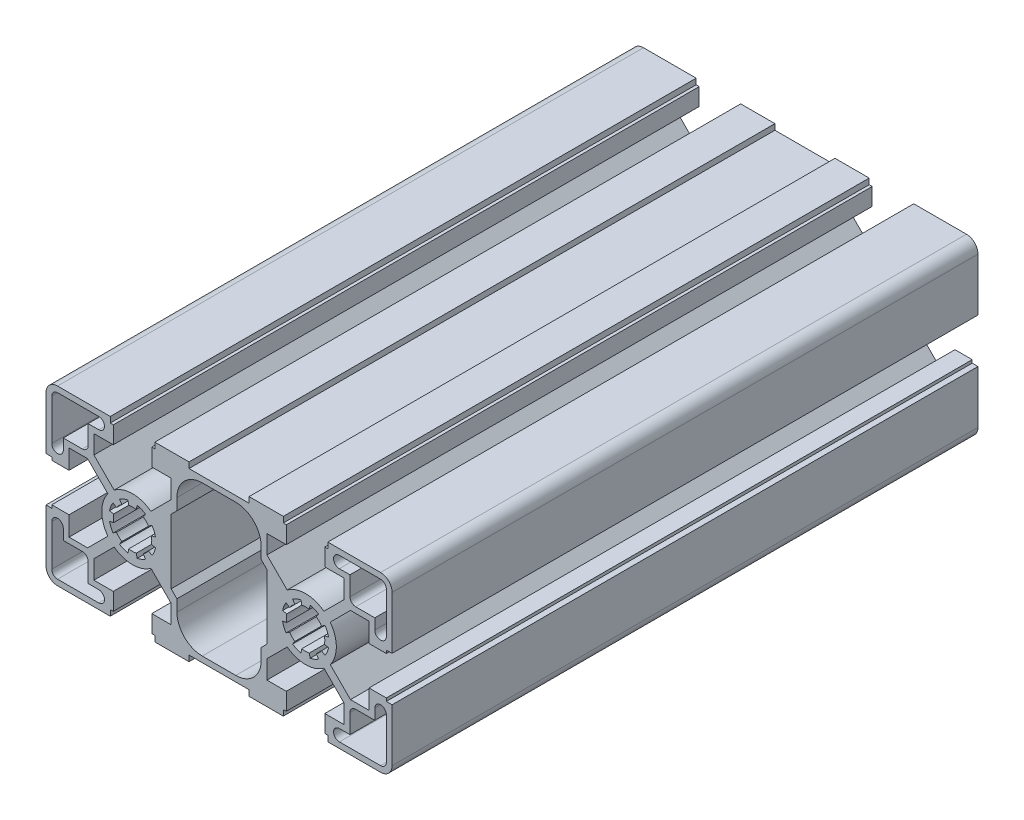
from build123d import *

# Parameters (mm, degrees)
BOSS_EXTRUDE1_DEPTH = 76.2


with BuildPart() as part:
    # Sketch1 → Boss-Extrude1 (new, symmetric)
    with BuildSketch(Plane.XY):
        with BuildLine():
            Line((-42.0116, 22.5044), (-28.2956, 22.5044))
            Line((-28.2956, 22.5044), (-28.2956, 21.0058))
            Line((-28.2956, 21.0058), (-27.5082, 21.0058))
            Line((-27.5082, 21.0058), (-27.5082, 16.51))
            Line((-27.5082, 16.51), (-32.5501, 16.51))
            Line((-32.5501, 16.51), (-32.5501, 11.680106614))
            Line((-32.5501, 11.680106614), (-27.285426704, 6.415433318))
            ThreePointArc((-27.285426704, 6.415433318), (-22.5044, 8.001), (-17.723373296, 6.415433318))
            Line((-17.723373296, 6.415433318), (-12.4587, 11.680106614))
            Line((-12.4587, 11.680106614), (-12.4587, 16.51))
            Line((-12.4587, 16.51), (-17.5006, 16.51))
            Line((-17.5006, 16.51), (-17.5006, 21.0058))
            Line((-17.5006, 21.0058), (-16.7132, 21.0058))
            Line((-16.7132, 21.0058), (-16.7132, 22.5044))
            Line((-16.7132, 22.5044), (-7.8105, 22.5044))
            Line((-7.8105, 22.5044), (-7.8105, 21.0058))
            Line((-7.8105, 21.0058), (7.8105, 21.0058))
            Line((7.8105, 21.0058), (7.8105, 22.5044))
            Line((7.8105, 22.5044), (16.7132, 22.5044))
            Line((16.7132, 22.5044), (16.7132, 21.0058))
            Line((16.7132, 21.0058), (17.5006, 21.0058))
            Line((17.5006, 21.0058), (17.5006, 16.51))
            Line((17.5006, 16.51), (12.4587, 16.51))
            Line((12.4587, 16.51), (12.4587, 11.680106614))
            Line((12.4587, 11.680106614), (17.723373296, 6.415433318))
            ThreePointArc((17.723373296, 6.415433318), (22.5044, 8.001), (27.285426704, 6.415433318))
            Line((27.285426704, 6.415433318), (32.5501, 11.680106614))
            Line((32.5501, 11.680106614), (32.5501, 16.51))
            Line((32.5501, 16.51), (27.5082, 16.51))
            Line((27.5082, 16.51), (27.5082, 21.0058))
            Line((27.5082, 21.0058), (28.2956, 21.0058))
            Line((28.2956, 21.0058), (28.2956, 22.5044))
            Line((28.2956, 22.5044), (42.0116, 22.5044))
            ThreePointArc((42.0116, 22.5044), (44.130940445, 21.626540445), (45.0088, 19.5072))
            Line((45.0088, 19.5072), (45.0088, 5.7912))
            Line((45.0088, 5.7912), (43.5102, 5.7912))
            Line((43.5102, 5.7912), (43.5102, 5.0038))
            Line((43.5102, 5.0038), (39.0144, 5.0038))
            Line((39.0144, 5.0038), (39.0144, 10.0457))
            Line((39.0144, 10.0457), (34.184506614, 10.0457))
            Line((34.184506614, 10.0457), (28.919833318, 4.781026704))
            ThreePointArc((28.919833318, 4.781026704), (30.5054, 0), (28.919833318, -4.781026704))
            Line((28.919833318, -4.781026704), (34.184506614, -10.0457))
            Line((34.184506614, -10.0457), (39.0144, -10.0457))
            Line((39.0144, -10.0457), (39.0144, -5.0038))
            Line((39.0144, -5.0038), (43.5102, -5.0038))
            Line((43.5102, -5.0038), (43.5102, -5.7912))
            Line((43.5102, -5.7912), (45.0088, -5.7912))
            Line((45.0088, -5.7912), (45.0088, -19.5072))
            ThreePointArc((45.0088, -19.5072), (44.130940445, -21.626540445), (42.0116, -22.5044))
            Line((42.0116, -22.5044), (28.2956, -22.5044))
            Line((28.2956, -22.5044), (28.2956, -21.0058))
            Line((28.2956, -21.0058), (27.5082, -21.0058))
            Line((27.5082, -21.0058), (27.5082, -16.51))
            Line((27.5082, -16.51), (32.5501, -16.51))
            Line((32.5501, -16.51), (32.5501, -11.680106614))
            Line((32.5501, -11.680106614), (27.285426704, -6.415433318))
            ThreePointArc((27.285426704, -6.415433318), (22.5044, -8.001), (17.723373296, -6.415433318))
            Line((17.723373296, -6.415433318), (12.4587, -11.680106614))
            Line((12.4587, -11.680106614), (12.4587, -16.51))
            Line((12.4587, -16.51), (17.5006, -16.51))
            Line((17.5006, -16.51), (17.5006, -21.0058))
            Line((17.5006, -21.0058), (16.7132, -21.0058))
            Line((16.7132, -21.0058), (16.7132, -22.5044))
            Line((16.7132, -22.5044), (7.8105, -22.5044))
            Line((7.8105, -22.5044), (7.8105, -21.0058))
            Line((7.8105, -21.0058), (-7.8105, -21.0058))
            Line((-7.8105, -21.0058), (-7.8105, -22.5044))
            Line((-7.8105, -22.5044), (-16.7132, -22.5044))
            Line((-16.7132, -22.5044), (-16.7132, -21.0058))
            Line((-16.7132, -21.0058), (-17.5006, -21.0058))
            Line((-17.5006, -21.0058), (-17.5006, -16.51))
            Line((-17.5006, -16.51), (-12.4587, -16.51))
            Line((-12.4587, -16.51), (-12.4587, -11.680106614))
            Line((-12.4587, -11.680106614), (-17.723373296, -6.415433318))
            ThreePointArc((-17.723373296, -6.415433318), (-22.5044, -8.001), (-27.285426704, -6.415433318))
            Line((-27.285426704, -6.415433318), (-32.5501, -11.680106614))
            Line((-32.5501, -11.680106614), (-32.5501, -16.51))
            Line((-32.5501, -16.51), (-27.5082, -16.51))
            Line((-27.5082, -16.51), (-27.5082, -21.0058))
            Line((-27.5082, -21.0058), (-28.2956, -21.0058))
            Line((-28.2956, -21.0058), (-28.2956, -22.5044))
            Line((-28.2956, -22.5044), (-42.0116, -22.5044))
            ThreePointArc((-42.0116, -22.5044), (-44.130940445, -21.626540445), (-45.0088, -19.5072))
            Line((-45.0088, -19.5072), (-45.0088, -5.7912))
            Line((-45.0088, -5.7912), (-43.5102, -5.7912))
            Line((-43.5102, -5.7912), (-43.5102, -5.0038))
            Line((-43.5102, -5.0038), (-39.0144, -5.0038))
            Line((-39.0144, -5.0038), (-39.0144, -10.0457))
            Line((-39.0144, -10.0457), (-34.184506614, -10.0457))
            Line((-34.184506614, -10.0457), (-28.919833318, -4.781026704))
            ThreePointArc((-28.919833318, -4.781026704), (-30.5054, 0), (-28.919833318, 4.781026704))
            Line((-28.919833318, 4.781026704), (-34.184506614, 10.0457))
            Line((-34.184506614, 10.0457), (-39.0144, 10.0457))
            Line((-39.0144, 10.0457), (-39.0144, 5.0038))
            Line((-39.0144, 5.0038), (-43.5102, 5.0038))
            Line((-43.5102, 5.0038), (-43.5102, 5.7912))
            Line((-43.5102, 5.7912), (-45.0088, 5.7912))
            Line((-45.0088, 5.7912), (-45.0088, 19.5072))
            ThreePointArc((-45.0088, 19.5072), (-44.130940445, 21.626540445), (-42.0116, 22.5044))
        make_face()
        with BuildLine():
            Line((-40.513, 11.5443), (-35.5473, 11.5443))
            ThreePointArc((-35.5473, 11.5443), (-34.487629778, 11.983229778), (-34.0487, 13.0429))
            Line((-34.0487, 13.0429), (-34.0487, 18.0086))
            Line((-34.0487, 18.0086), (-31.2928, 18.0086))
            ThreePointArc((-31.2928, 18.0086), (-29.7942, 19.5072), (-31.2928, 21.0058))
            Line((-31.2928, 21.0058), (-42.0116, 21.0058))
            ThreePointArc((-42.0116, 21.0058), (-43.071270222, 20.566870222), (-43.5102, 19.5072))
            Line((-43.5102, 19.5072), (-43.5102, 8.7884))
            ThreePointArc((-43.5102, 8.7884), (-42.0116, 7.2898), (-40.513, 8.7884))
            Line((-40.513, 8.7884), (-40.513, 11.5443))
        make_face(mode=Mode.SUBTRACT)
        with BuildLine():
            Line((-21.315129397, 5.978867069), (-21.528207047, 4.907653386))
            ThreePointArc((-21.528207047, 4.907653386), (-22.5044, 5.0038), (-23.480592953, 4.907653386))
            Line((-23.480592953, 4.907653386), (-23.693670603, 5.978867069))
            ThreePointArc((-23.693670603, 5.978867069), (-24.837238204, 5.63196963), (-25.89115614, 5.068638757))
            Line((-25.89115614, 5.068638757), (-25.284362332, 4.160507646))
            ThreePointArc((-25.284362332, 4.160507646), (-26.042620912, 3.538220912), (-26.664907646, 2.779962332))
            Line((-26.664907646, 2.779962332), (-27.573038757, 3.38675614))
            ThreePointArc((-27.573038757, 3.38675614), (-28.13636963, 2.332838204), (-28.483267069, 1.189270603))
            Line((-28.483267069, 1.189270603), (-27.412053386, 0.976192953))
            ThreePointArc((-27.412053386, 0.976192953), (-27.5082, 0), (-27.412053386, -0.976192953))
            Line((-27.412053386, -0.976192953), (-28.483267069, -1.189270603))
            ThreePointArc((-28.483267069, -1.189270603), (-28.13636963, -2.332838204), (-27.573038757, -3.38675614))
            Line((-27.573038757, -3.38675614), (-26.664907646, -2.779962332))
            ThreePointArc((-26.664907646, -2.779962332), (-26.042620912, -3.538220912), (-25.284362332, -4.160507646))
            Line((-25.284362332, -4.160507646), (-25.89115614, -5.068638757))
            ThreePointArc((-25.89115614, -5.068638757), (-24.837238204, -5.63196963), (-23.693670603, -5.978867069))
            Line((-23.693670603, -5.978867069), (-23.480592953, -4.907653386))
            ThreePointArc((-23.480592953, -4.907653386), (-22.5044, -5.0038), (-21.528207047, -4.907653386))
            Line((-21.528207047, -4.907653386), (-21.315129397, -5.978867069))
            ThreePointArc((-21.315129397, -5.978867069), (-20.171561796, -5.63196963), (-19.11764386, -5.068638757))
            Line((-19.11764386, -5.068638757), (-19.724437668, -4.160507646))
            ThreePointArc((-19.724437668, -4.160507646), (-18.966179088, -3.538220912), (-18.343892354, -2.779962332))
            Line((-18.343892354, -2.779962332), (-17.435761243, -3.38675614))
            ThreePointArc((-17.435761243, -3.38675614), (-16.87243037, -2.332838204), (-16.525532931, -1.189270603))
            Line((-16.525532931, -1.189270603), (-17.596746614, -0.976192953))
            ThreePointArc((-17.596746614, -0.976192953), (-17.5006, 0), (-17.596746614, 0.976192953))
            Line((-17.596746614, 0.976192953), (-16.525532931, 1.189270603))
            ThreePointArc((-16.525532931, 1.189270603), (-16.87243037, 2.332838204), (-17.435761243, 3.38675614))
            Line((-17.435761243, 3.38675614), (-18.343892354, 2.779962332))
            ThreePointArc((-18.343892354, 2.779962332), (-18.966179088, 3.538220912), (-19.724437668, 4.160507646))
            Line((-19.724437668, 4.160507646), (-19.11764386, 5.068638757))
            ThreePointArc((-19.11764386, 5.068638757), (-20.171561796, 5.63196963), (-21.315129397, 5.978867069))
        make_face(mode=Mode.SUBTRACT)
        with BuildLine():
            Line((-10.9601, 9.909893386), (-12.4587, 8.411293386))
            Line((-12.4587, 8.411293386), (-12.4587, -8.411293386))
            Line((-12.4587, -8.411293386), (-10.9601, -9.909893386))
            Line((-10.9601, -9.909893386), (-10.9601, -12.9032))
            ThreePointArc((-10.9601, -12.9032), (-9.025833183, -17.572933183), (-4.3561, -19.5072))
            Line((-4.3561, -19.5072), (4.3561, -19.5072))
            ThreePointArc((4.3561, -19.5072), (9.025833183, -17.572933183), (10.9601, -12.9032))
            Line((10.9601, -12.9032), (10.9601, -9.909893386))
            Line((10.9601, -9.909893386), (12.4587, -8.411293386))
            Line((12.4587, -8.411293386), (12.4587, 8.411293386))
            Line((12.4587, 8.411293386), (10.9601, 9.909893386))
            Line((10.9601, 9.909893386), (10.9601, 12.9032))
            ThreePointArc((10.9601, 12.9032), (9.025833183, 17.572933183), (4.3561, 19.5072))
            Line((4.3561, 19.5072), (-4.3561, 19.5072))
            ThreePointArc((-4.3561, 19.5072), (-9.025833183, 17.572933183), (-10.9601, 12.9032))
            Line((-10.9601, 12.9032), (-10.9601, 9.909893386))
        make_face(mode=Mode.SUBTRACT)
        with BuildLine():
            Line((-40.513, -11.5443), (-35.5473, -11.5443))
            ThreePointArc((-35.5473, -11.5443), (-34.487629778, -11.983229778), (-34.0487, -13.0429))
            Line((-34.0487, -13.0429), (-34.0487, -18.0086))
            Line((-34.0487, -18.0086), (-31.2928, -18.0086))
            ThreePointArc((-31.2928, -18.0086), (-29.7942, -19.5072), (-31.2928, -21.0058))
            Line((-31.2928, -21.0058), (-42.0116, -21.0058))
            ThreePointArc((-42.0116, -21.0058), (-43.071270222, -20.566870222), (-43.5102, -19.5072))
            Line((-43.5102, -19.5072), (-43.5102, -8.7884))
            ThreePointArc((-43.5102, -8.7884), (-42.0116, -7.2898), (-40.513, -8.7884))
            Line((-40.513, -8.7884), (-40.513, -11.5443))
        make_face(mode=Mode.SUBTRACT)
        with BuildLine():
            Line((42.0116, 21.0058), (31.2928, 21.0058))
            ThreePointArc((31.2928, 21.0058), (29.7942, 19.5072), (31.2928, 18.0086))
            Line((31.2928, 18.0086), (34.0487, 18.0086))
            Line((34.0487, 18.0086), (34.0487, 13.0429))
            ThreePointArc((34.0487, 13.0429), (34.487629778, 11.983229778), (35.5473, 11.5443))
            Line((35.5473, 11.5443), (40.513, 11.5443))
            Line((40.513, 11.5443), (40.513, 8.7884))
            ThreePointArc((40.513, 8.7884), (42.0116, 7.2898), (43.5102, 8.7884))
            Line((43.5102, 8.7884), (43.5102, 19.5072))
            ThreePointArc((43.5102, 19.5072), (43.071270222, 20.566870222), (42.0116, 21.0058))
        make_face(mode=Mode.SUBTRACT)
        with BuildLine():
            Line((40.513, -11.5443), (35.5473, -11.5443))
            ThreePointArc((35.5473, -11.5443), (34.487629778, -11.983229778), (34.0487, -13.0429))
            Line((34.0487, -13.0429), (34.0487, -18.0086))
            Line((34.0487, -18.0086), (31.2928, -18.0086))
            ThreePointArc((31.2928, -18.0086), (29.7942, -19.5072), (31.2928, -21.0058))
            Line((31.2928, -21.0058), (42.0116, -21.0058))
            ThreePointArc((42.0116, -21.0058), (43.071270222, -20.566870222), (43.5102, -19.5072))
            Line((43.5102, -19.5072), (43.5102, -8.7884))
            ThreePointArc((43.5102, -8.7884), (42.0116, -7.2898), (40.513, -8.7884))
            Line((40.513, -8.7884), (40.513, -11.5443))
        make_face(mode=Mode.SUBTRACT)
        with BuildLine():
            Line((27.573038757, 3.38675614), (26.664907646, 2.779962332))
            ThreePointArc((26.664907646, 2.779962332), (26.042620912, 3.538220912), (25.284362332, 4.160507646))
            Line((25.284362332, 4.160507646), (25.89115614, 5.068638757))
            ThreePointArc((25.89115614, 5.068638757), (24.837238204, 5.63196963), (23.693670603, 5.978867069))
            Line((23.693670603, 5.978867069), (23.480592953, 4.907653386))
            ThreePointArc((23.480592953, 4.907653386), (22.5044, 5.0038), (21.528207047, 4.907653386))
            Line((21.528207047, 4.907653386), (21.315129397, 5.978867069))
            ThreePointArc((21.315129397, 5.978867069), (20.171561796, 5.63196963), (19.11764386, 5.068638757))
            Line((19.11764386, 5.068638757), (19.724437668, 4.160507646))
            ThreePointArc((19.724437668, 4.160507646), (18.966179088, 3.538220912), (18.343892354, 2.779962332))
            Line((18.343892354, 2.779962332), (17.435761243, 3.38675614))
            ThreePointArc((17.435761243, 3.38675614), (16.87243037, 2.332838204), (16.525532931, 1.189270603))
            Line((16.525532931, 1.189270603), (17.596746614, 0.976192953))
            ThreePointArc((17.596746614, 0.976192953), (17.5006, 0), (17.596746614, -0.976192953))
            Line((17.596746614, -0.976192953), (16.525532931, -1.189270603))
            ThreePointArc((16.525532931, -1.189270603), (16.87243037, -2.332838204), (17.435761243, -3.38675614))
            Line((17.435761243, -3.38675614), (18.343892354, -2.779962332))
            ThreePointArc((18.343892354, -2.779962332), (18.966179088, -3.538220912), (19.724437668, -4.160507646))
            Line((19.724437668, -4.160507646), (19.11764386, -5.068638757))
            ThreePointArc((19.11764386, -5.068638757), (20.171561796, -5.63196963), (21.315129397, -5.978867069))
            Line((21.315129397, -5.978867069), (21.528207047, -4.907653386))
            ThreePointArc((21.528207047, -4.907653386), (22.5044, -5.0038), (23.480592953, -4.907653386))
            Line((23.480592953, -4.907653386), (23.693670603, -5.978867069))
            ThreePointArc((23.693670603, -5.978867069), (24.837238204, -5.63196963), (25.89115614, -5.068638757))
            Line((25.89115614, -5.068638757), (25.284362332, -4.160507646))
            ThreePointArc((25.284362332, -4.160507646), (26.042620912, -3.538220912), (26.664907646, -2.779962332))
            Line((26.664907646, -2.779962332), (27.573038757, -3.38675614))
            ThreePointArc((27.573038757, -3.38675614), (28.13636963, -2.332838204), (28.483267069, -1.189270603))
            Line((28.483267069, -1.189270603), (27.412053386, -0.976192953))
            ThreePointArc((27.412053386, -0.976192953), (27.5082, 0), (27.412053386, 0.976192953))
            Line((27.412053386, 0.976192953), (28.483267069, 1.189270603))
            ThreePointArc((28.483267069, 1.189270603), (28.13636963, 2.332838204), (27.573038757, 3.38675614))
        make_face(mode=Mode.SUBTRACT)
    extrude(amount=BOSS_EXTRUDE1_DEPTH, both=True)


solid = part.part
